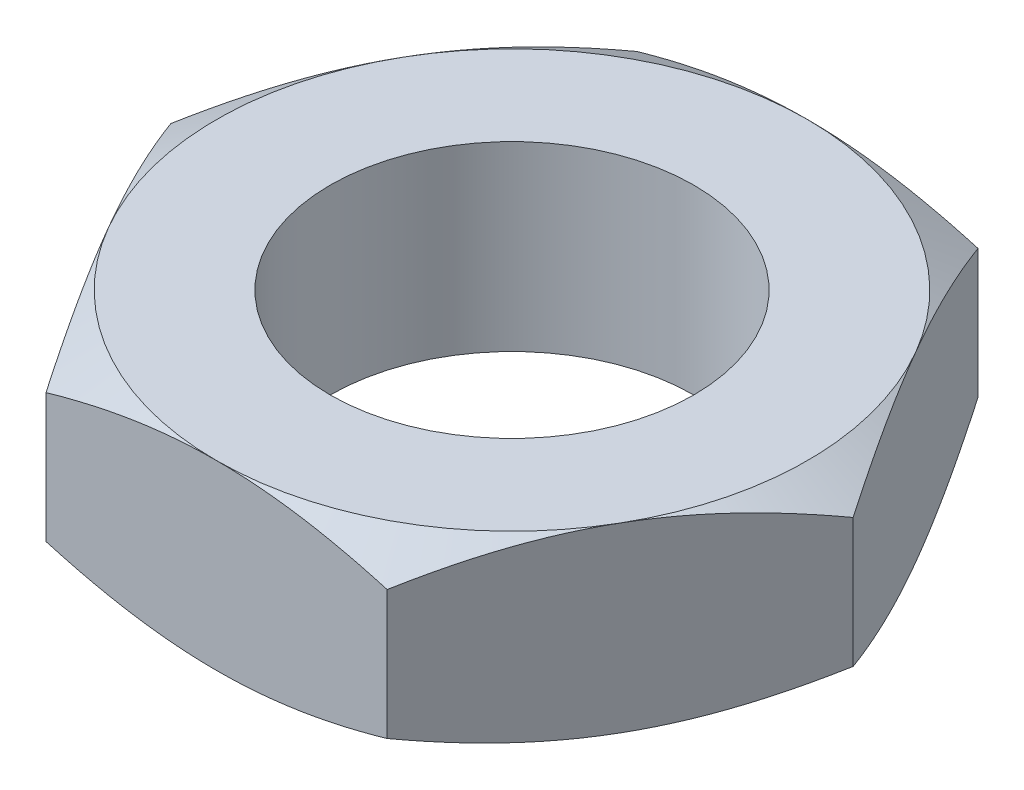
from build123d import *

# Parameters (mm, degrees)
SKETCH4_OUTSIDE_W  = 21.332
SKETCH4_OUTSIDE_H  = 21.332
CUT_EXTRUDE1_DEPTH = 12.343133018


with BuildPart() as part:
    # Sketch2 → Base-Revolve (revolve)
    with BuildSketch(Plane.XY, mode=Mode.PRIVATE) as base_revolve_sk:
        Polygon((6.5, 2), (7.505553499, 1.419443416), (7.505553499, -1.419443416), (6.5, -2), (4, -2), (4, 2), align=None)
    revolve(base_revolve_sk.sketch.rotate(Axis((0, -2, 0), (0, 1, 0)), 90), axis=Axis((0, -2, 0), (0, 1, 0)))

    # Sketch4 outside → Cut-Extrude1 (cut, through all)
    with BuildSketch(Plane(origin=(0, 2, 0), x_dir=(-1, 0, 0), z_dir=(0, 1, 0))):
        Rectangle(SKETCH4_OUTSIDE_W, SKETCH4_OUTSIDE_H)
        Polygon((-7.505553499, 0), (-3.75277675, -6.5), (3.75277675, -6.5), (7.505553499, 0), (3.75277675, 6.5), (-3.75277675, 6.5), align=None, mode=Mode.SUBTRACT)
    extrude(amount=-CUT_EXTRUDE1_DEPTH, mode=Mode.SUBTRACT)


solid = part.part
